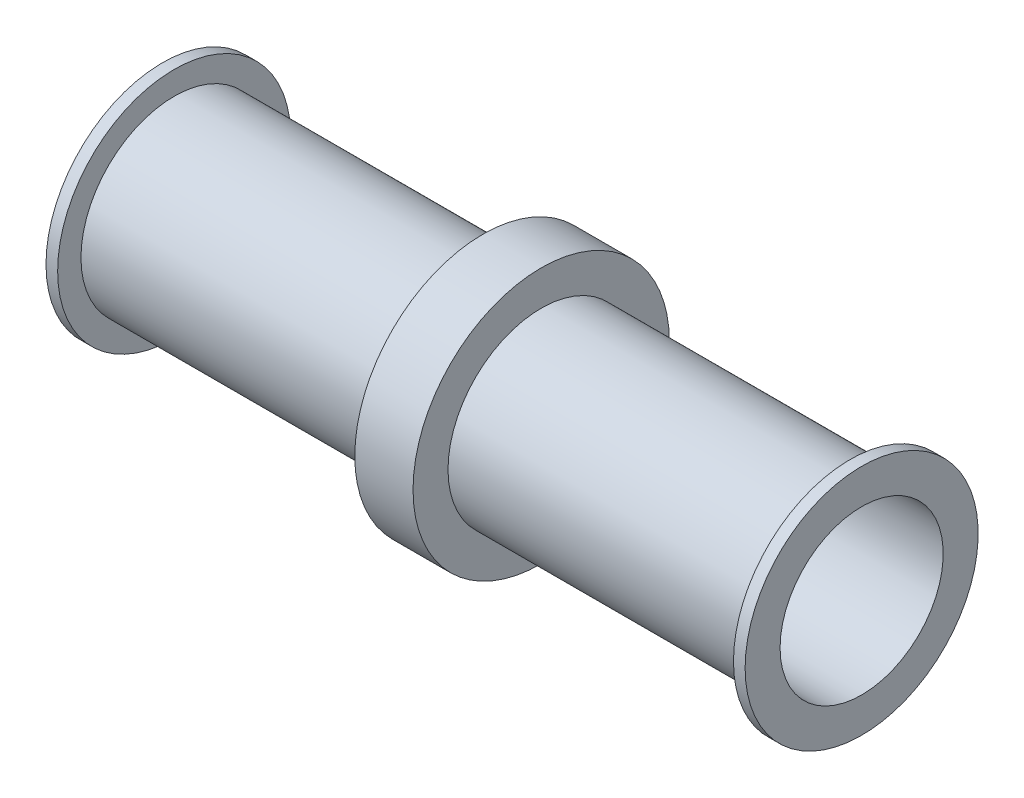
from build123d import *


with BuildPart() as part:
    # Sketch1 → Revolve1 (revolve)
    with BuildSketch(Plane.XY, mode=Mode.PRIVATE) as revolve1_sk:
        Polygon((0, 1.778), (0, 2.54), (0.254, 2.54), (0.254, 2.032), (6.985, 2.032), (6.985, 2.794), (8.255, 2.794), (8.255, 2.032), (14.986, 2.032), (14.986, 2.54), (15.24, 2.54), (15.24, 1.778), align=None)
    revolve(revolve1_sk.sketch.rotate(Axis((0, 0, 0), (1, 0, 0)), 90), axis=Axis((0, 0, 0), (1, 0, 0)))


solid = part.part
